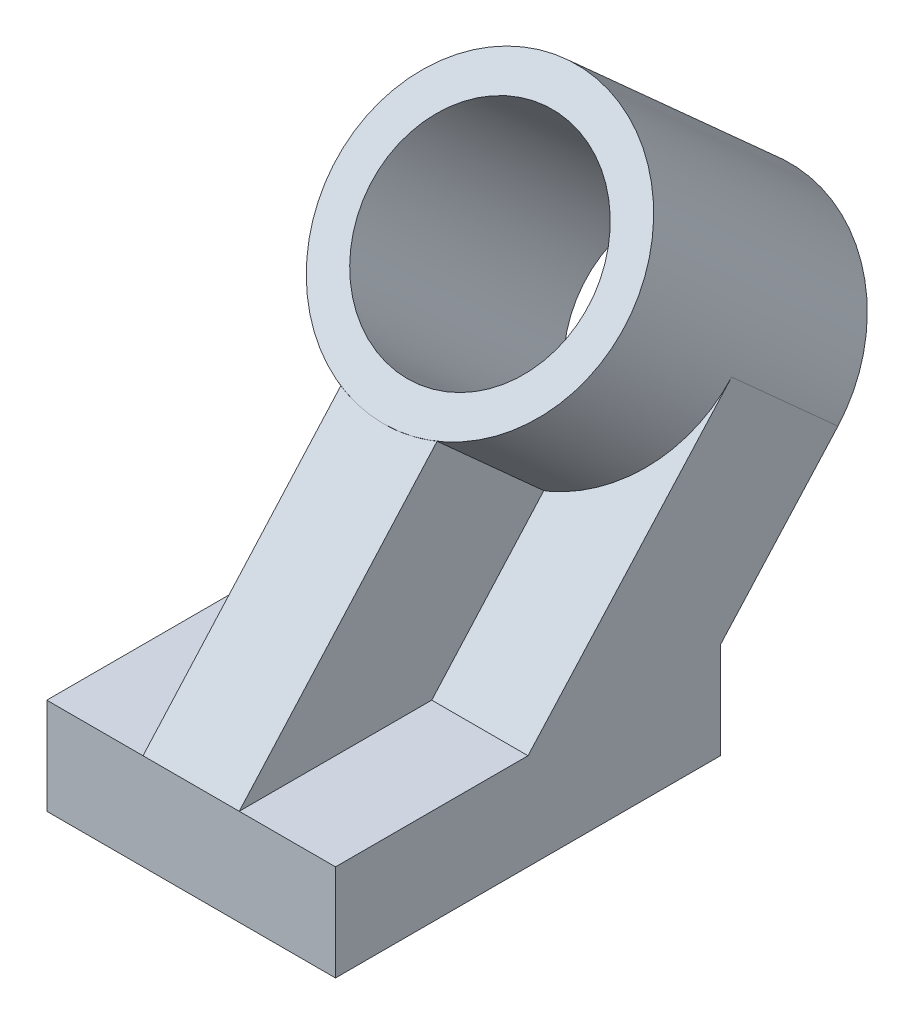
from build123d import *

# Parameters (mm, degrees)
BOSS_EXTRUDE1_DEPTH = 38.1
CUT_EXTRUDE5_DEPTH  = 38.1
BOSS_EXTRUDE2_START = 38.1
SKETCH7_R           = 38.1
BOSS_EXTRUDE2_DEPTH = 38.1
CUT_EXTRUDE6_REACH  = 185.935
SKETCH8_R           = 28.575
BOSS_EXTRUDE4_DEPTH = 12.7


with BuildPart() as part:
    # Sketch1 → Boss-Extrude1 (new, symmetric)
    with BuildSketch(Plane(origin=(0, 0, 0), x_dir=(0, 0, -1), z_dir=(1, 0, 0))):
        Polygon((-50.8, 0), (50.8, 0), (50.8, 25.4), (107.285550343, 88.133559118), (79.230527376, 113.39441526), (0, 25.4), (-50.8, 25.4), align=None)
    extrude(amount=BOSS_EXTRUDE1_DEPTH, both=True)

    # Sketch6 → Cut-Extrude5 (cut)
    with BuildSketch(Plane(origin=(0, 11.372488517, 12.630428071), x_dir=(1, 0, 0), z_dir=(0, 0.6691306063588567, 0.7431448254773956))):
        with BuildLine():
            ThreePointArc((-38.1, 99.184043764), (-26.940768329, 126.124812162), (9.8e-08, 137.284043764))
            Line((9.8e-08, 137.284043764), (-38.1, 137.284043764))
            Line((-38.1, 137.284043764), (-38.1, 99.184043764))
        make_face()
        with BuildLine():
            ThreePointArc((9.8e-08, 137.284043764), (26.940768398, 126.124812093), (38.1, 99.184043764))
            Line((38.1, 99.184043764), (38.1, 137.284043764))
            Line((38.1, 137.284043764), (9.8e-08, 137.284043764))
        make_face()
    extrude(amount=-CUT_EXTRUDE5_DEPTH, mode=Mode.SUBTRACT)

    # Sketch7 → Boss-Extrude2 (add)
    with BuildSketch(Plane(origin=(0, 11.372488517, 12.630428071), x_dir=(1, 0, 0), z_dir=(0, 0.6691306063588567, 0.7431448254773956)).offset(BOSS_EXTRUDE2_START)):
        with Locations(Location((0, 99.184043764, 0), (0, 0, 270))):
            Circle(SKETCH7_R)
    extrude(amount=-BOSS_EXTRUDE2_DEPTH)

    # Sketch8 → Cut-Extrude6 (cut, up to next)
    with BuildSketch(Plane(origin=(0, 36.866364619, 40.944245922), x_dir=(1, 0, 0), z_dir=(0, 0.6691306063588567, 0.7431448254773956)), mode=Mode.PRIVATE) as cut_extrude6_sk1:
        with Locations(Location((0, 99.184043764, 0), (0, 0, 270))):
            Circle(SKETCH8_R)
    cut_extrude6_tool1 = extrude(cut_extrude6_sk1.sketch, amount=-CUT_EXTRUDE6_REACH, mode=Mode.PRIVATE) & part.part
    add(cut_extrude6_tool1.solids().sort_by_distance((0, 110.574474, -25.422833))[0], mode=Mode.SUBTRACT)

    # Sketch11 → Boss-Extrude4 (add, symmetric)
    with BuildSketch(Plane(origin=(0, 0, 0), x_dir=(0, 0, -1), z_dir=(1, 0, 0))):
        Polygon((6.302426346, 89.339110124), (-50.8, 25.4), (0, 25.4), (34.460067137, 63.985856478), align=None)
    extrude(amount=BOSS_EXTRUDE4_DEPTH, both=True)


solid = part.part
